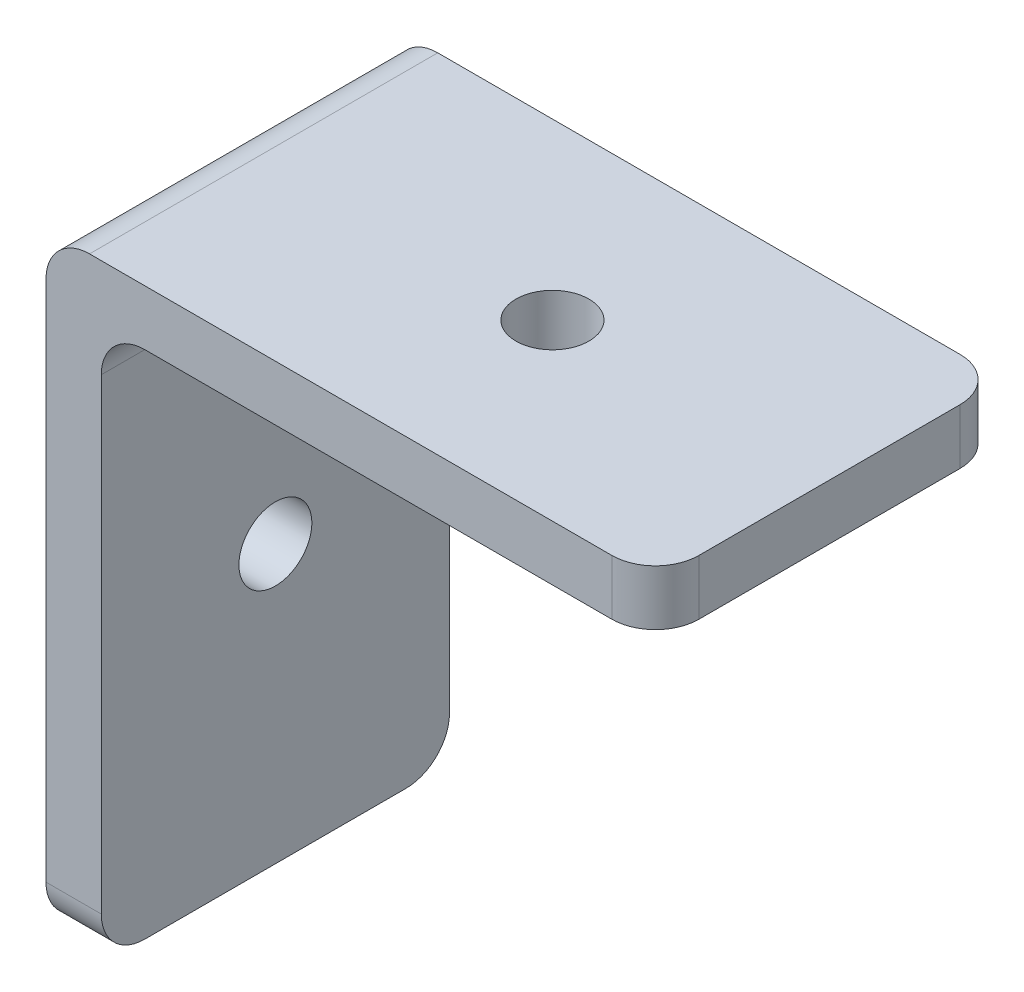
from build123d import *

# Parameters (mm, degrees)
SKETCH1_W           = 3.175
SKETCH1_H           = 3.175
SKETCH1_W_2         = 31.825
SKETCH1_H_2         = 31.825
BOSS_EXTRUDE1_DEPTH = 20
SKETCH2_R           = 2.095
CUT_EXTRUDE1_DEPTH  = 219.260923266
FILLET1_R           = 2.5


with BuildPart() as part:
    # Sketch1 → Boss-Extrude1 (new body)
    with BuildSketch(Plane.XY):
        with Locations((11.5875, 213.4125)):
            Rectangle(SKETCH1_W, SKETCH1_H)
        with Locations((29.0875, 213.4125)):
            Rectangle(SKETCH1_W_2, SKETCH1_H)
        with Locations((11.5875, 195.9125)):
            Rectangle(SKETCH1_W, SKETCH1_H_2)
    extrude(amount=-BOSS_EXTRUDE1_DEPTH)

    # Sketch2 → Cut-Extrude1 (cut, through all)
    with BuildSketch(Plane(origin=(13.175, 0, 0), x_dir=(0, 0, -1), z_dir=(1, 0, 0))):
        with Locations(Location((10, 195.9125, 0), (0, 0, 90))):
            Circle(SKETCH2_R)
    cut_extrude1 = extrude(amount=-CUT_EXTRUDE1_DEPTH, mode=Mode.SUBTRACT)

    # Fillet1
    fillet1_edges = [part.edges().sort_by_distance(p)[0] for p in [
        (13.175, 211.825, -10),
        (10, 215, -10),
        (45, 213.4125, -20),
        (11.5875, 180, -20),
        (11.5875, 180, 0),
        (45, 213.4125, 0),
    ]]
    fillet(fillet1_edges, radius=FILLET1_R)

    # Mirror1: Cut-Extrude1 across plane
    add(cut_extrude1.mirror(Plane(origin=(112.5, 112.5, 0), x_dir=(0, 0, 1), z_dir=(0.7071067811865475, 0.7071067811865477, 0))), mode=Mode.SUBTRACT)


solid = part.part
